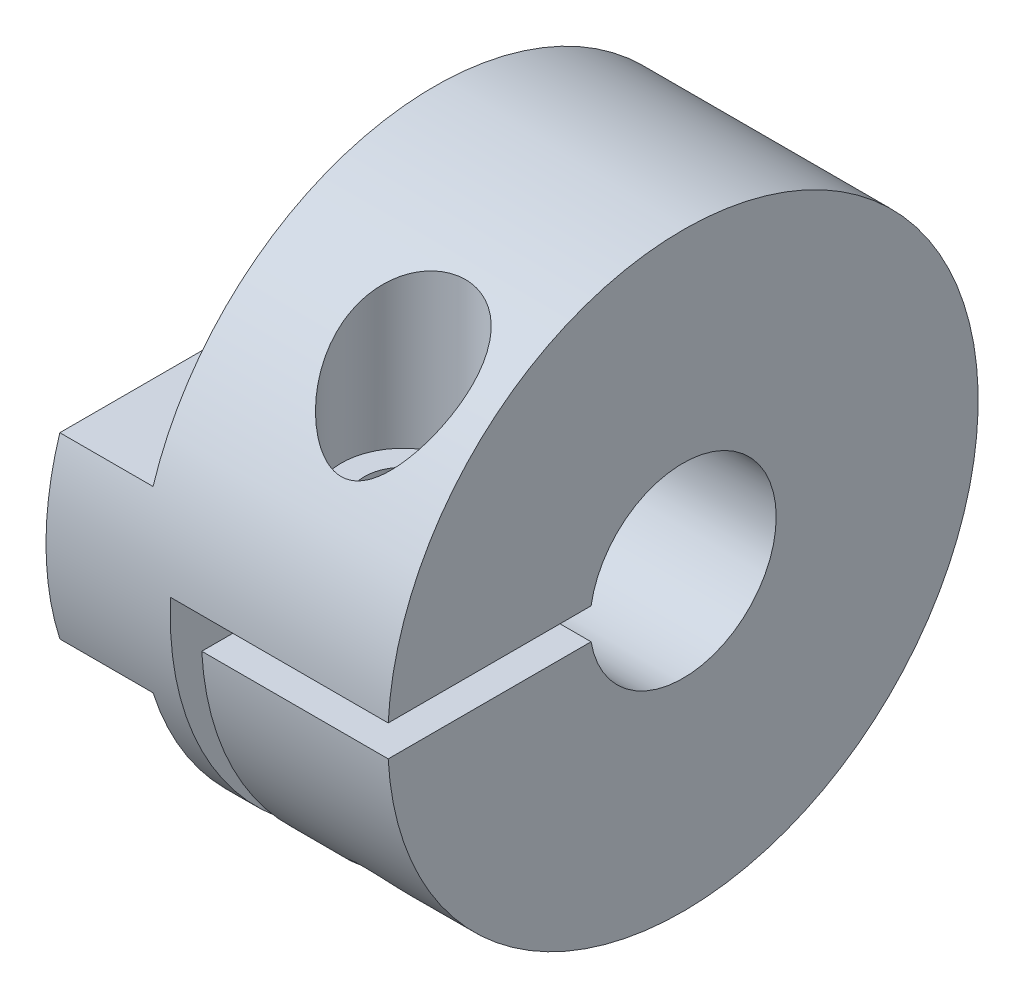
ISO-10303-21;
HEADER;
FILE_DESCRIPTION(('STEP AP214'),'2;1');
FILE_NAME('part.step','',(''),(''),'','','');
FILE_SCHEMA(('AUTOMOTIVE_DESIGN { 1 0 10303 214 1 1 1 1 }'));
ENDSEC;
DATA;
#1=APPLICATION_CONTEXT('core data for automotive mechanical design processes');
#2=APPLICATION_PROTOCOL_DEFINITION('international standard','automotive_design',2000,#1);
#3=PRODUCT_CONTEXT('',#1,'mechanical');
#4=PRODUCT('Part','Part','',(#3));
#5=PRODUCT_RELATED_PRODUCT_CATEGORY('part','',(#4));
#6=PRODUCT_DEFINITION_FORMATION('','',#4);
#7=PRODUCT_DEFINITION_CONTEXT('part definition',#1,'design');
#8=PRODUCT_DEFINITION('design','',#6,#7);
#9=PRODUCT_DEFINITION_SHAPE('','',#8);
#10=(LENGTH_UNIT() NAMED_UNIT(*) SI_UNIT(.MILLI.,.METRE.));
#11=(NAMED_UNIT(*) PLANE_ANGLE_UNIT() SI_UNIT($,.RADIAN.));
#12=(NAMED_UNIT(*) SI_UNIT($,.STERADIAN.) SOLID_ANGLE_UNIT());
#13=UNCERTAINTY_MEASURE_WITH_UNIT(LENGTH_MEASURE(1.E-05),#10,'distance_accuracy_value','');
#14=(GEOMETRIC_REPRESENTATION_CONTEXT(3) GLOBAL_UNCERTAINTY_ASSIGNED_CONTEXT((#13)) GLOBAL_UNIT_ASSIGNED_CONTEXT((#10,
#11,#12)) REPRESENTATION_CONTEXT('',''));
#15=CARTESIAN_POINT('',(0.,0.,0.));
#16=DIRECTION('',(0.,0.,1.));
#17=DIRECTION('',(1.,0.,0.));
#18=AXIS2_PLACEMENT_3D('',#15,#16,#17);
#19=CARTESIAN_POINT('',(0.,0.,0.));
#20=DIRECTION('',(-1.,0.,0.));
#21=DIRECTION('',(0.,0.,1.));
#22=AXIS2_PLACEMENT_3D('',#19,#20,#21);
#23=CYLINDRICAL_SURFACE('',#22,3.);
#24=CARTESIAN_POINT('',(11.,0.,0.));
#25=DIRECTION('',(-1.,0.,0.));
#26=DIRECTION('',(0.,0.,1.));
#27=AXIS2_PLACEMENT_3D('',#24,#25,#26);
#28=CIRCLE('',#27,3.);
#29=CARTESIAN_POINT('',(11.,0.499999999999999,2.95803989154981));
#30=VERTEX_POINT('',#29);
#31=CARTESIAN_POINT('',(11.,-0.5,2.95803989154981));
#32=VERTEX_POINT('',#31);
#33=EDGE_CURVE('E129',#30,#32,#28,.T.);
#34=ORIENTED_EDGE('',*,*,#33,.F.);
#35=DIRECTION('',(-1.,0.,0.));
#36=VECTOR('',#35,1.);
#37=CARTESIAN_POINT('',(0.,0.499999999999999,2.95803989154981));
#38=LINE('',#37,#36);
#39=CARTESIAN_POINT('',(4.,0.499999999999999,2.95803989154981));
#40=VERTEX_POINT('',#39);
#41=EDGE_CURVE('E117',#30,#40,#38,.T.);
#42=ORIENTED_EDGE('',*,*,#41,.T.);
#43=CARTESIAN_POINT('',(4.,0.,0.));
#44=DIRECTION('',(-1.,0.,0.));
#45=DIRECTION('',(0.,0.,1.));
#46=AXIS2_PLACEMENT_3D('',#43,#44,#45);
#47=CIRCLE('',#46,3.);
#48=CARTESIAN_POINT('',(4.,0.,-3.));
#49=VERTEX_POINT('',#48);
#50=EDGE_CURVE('E127',#40,#49,#47,.T.);
#51=ORIENTED_EDGE('',*,*,#50,.T.);
#52=DIRECTION('',(-1.,0.,0.));
#53=VECTOR('',#52,1.);
#54=CARTESIAN_POINT('',(0.,0.,-3.));
#55=LINE('',#54,#53);
#56=CARTESIAN_POINT('',(5.,0.,-3.));
#57=VERTEX_POINT('',#56);
#58=EDGE_CURVE('E165',#57,#49,#55,.T.);
#59=ORIENTED_EDGE('',*,*,#58,.F.);
#60=CARTESIAN_POINT('',(5.,0.,0.));
#61=DIRECTION('',(1.,0.,0.));
#62=DIRECTION('',(0.,0.,-1.));
#63=AXIS2_PLACEMENT_3D('',#60,#61,#62);
#64=CIRCLE('',#63,3.);
#65=CARTESIAN_POINT('',(5.,-0.499999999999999,2.95803989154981));
#66=VERTEX_POINT('',#65);
#67=EDGE_CURVE('E163',#57,#66,#64,.F.);
#68=ORIENTED_EDGE('',*,*,#67,.T.);
#69=DIRECTION('',(-1.,0.,0.));
#70=VECTOR('',#69,1.);
#71=CARTESIAN_POINT('',(0.,-0.5,2.95803989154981));
#72=LINE('',#71,#70);
#73=EDGE_CURVE('E50',#66,#32,#72,.F.);
#74=ORIENTED_EDGE('',*,*,#73,.T.);
#75=EDGE_LOOP('',(#34,#42,#51,#59,#68,#74));
#76=FACE_BOUND('',#75,.T.);
#77=ADVANCED_FACE('F34',(#76),#23,.F.);
#78=CARTESIAN_POINT('',(0.,0.,0.));
#79=DIRECTION('',(-1.,0.,0.));
#80=DIRECTION('',(0.,0.,1.));
#81=AXIS2_PLACEMENT_3D('',#78,#79,#80);
#82=CYLINDRICAL_SURFACE('',#81,1.5);
#83=CARTESIAN_POINT('',(4.,0.,0.));
#84=DIRECTION('',(-1.,0.,0.));
#85=DIRECTION('',(0.,0.,1.));
#86=AXIS2_PLACEMENT_3D('',#83,#84,#85);
#87=CIRCLE('',#86,1.5);
#88=CARTESIAN_POINT('',(4.,0.,1.5));
#89=VERTEX_POINT('',#88);
#90=EDGE_CURVE('E136',#89,#89,#87,.T.);
#91=ORIENTED_EDGE('',*,*,#90,.F.);
#92=EDGE_LOOP('',(#91));
#93=FACE_BOUND('',#92,.T.);
#94=CARTESIAN_POINT('',(0.,0.,0.));
#95=DIRECTION('',(-1.,0.,0.));
#96=DIRECTION('',(0.,0.,1.));
#97=AXIS2_PLACEMENT_3D('',#94,#95,#96);
#98=CIRCLE('',#97,1.5);
#99=CARTESIAN_POINT('',(0.,0.,1.5));
#100=VERTEX_POINT('',#99);
#101=EDGE_CURVE('E189',#100,#100,#98,.T.);
#102=ORIENTED_EDGE('',*,*,#101,.T.);
#103=EDGE_LOOP('',(#102));
#104=FACE_BOUND('',#103,.T.);
#105=ADVANCED_FACE('F36',(#93,#104),#82,.F.);
#106=CARTESIAN_POINT('',(4.,3.,0.));
#107=DIRECTION('',(-1.,0.,0.));
#108=DIRECTION('',(0.,0.,1.));
#109=AXIS2_PLACEMENT_3D('',#106,#107,#108);
#110=PLANE('',#109);
#111=ORIENTED_EDGE('',*,*,#50,.F.);
#112=DIRECTION('',(0.,0.,1.));
#113=VECTOR('',#112,1.);
#114=CARTESIAN_POINT('',(4.,0.499999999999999,9.5));
#115=LINE('',#114,#113);
#116=CARTESIAN_POINT('',(4.,0.499999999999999,9.48683298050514));
#117=VERTEX_POINT('',#116);
#118=EDGE_CURVE('E114',#40,#117,#115,.T.);
#119=ORIENTED_EDGE('',*,*,#118,.T.);
#120=CARTESIAN_POINT('',(4.,0.,0.));
#121=DIRECTION('',(-1.,0.,0.));
#122=DIRECTION('',(0.,0.,1.));
#123=AXIS2_PLACEMENT_3D('',#120,#121,#122);
#124=CIRCLE('',#123,9.5);
#125=CARTESIAN_POINT('',(4.,0.,-9.5));
#126=VERTEX_POINT('',#125);
#127=EDGE_CURVE('E157',#126,#117,#124,.T.);
#128=ORIENTED_EDGE('',*,*,#127,.F.);
#129=DIRECTION('',(0.,0.,1.));
#130=VECTOR('',#129,1.);
#131=CARTESIAN_POINT('',(4.,0.,9.5));
#132=LINE('',#131,#130);
#133=EDGE_CURVE('E130',#126,#49,#132,.T.);
#134=ORIENTED_EDGE('',*,*,#133,.T.);
#135=EDGE_LOOP('',(#111,#119,#128,#134));
#136=FACE_BOUND('',#135,.T.);
#137=ORIENTED_EDGE('',*,*,#90,.T.);
#138=EDGE_LOOP('',(#137));
#139=FACE_BOUND('',#138,.T.);
#140=ADVANCED_FACE('F133',(#136,#139),#110,.F.);
#141=CARTESIAN_POINT('',(11.,9.5,0.));
#142=DIRECTION('',(-1.,0.,0.));
#143=DIRECTION('',(0.,0.,1.));
#144=AXIS2_PLACEMENT_3D('',#141,#142,#143);
#145=PLANE('',#144);
#146=CARTESIAN_POINT('',(11.,0.,0.));
#147=DIRECTION('',(-1.,0.,0.));
#148=DIRECTION('',(0.,0.,1.));
#149=AXIS2_PLACEMENT_3D('',#146,#147,#148);
#150=CIRCLE('',#149,9.5);
#151=CARTESIAN_POINT('',(11.,0.499999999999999,9.48683298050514));
#152=VERTEX_POINT('',#151);
#153=CARTESIAN_POINT('',(11.,-0.500000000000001,9.48683298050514));
#154=VERTEX_POINT('',#153);
#155=EDGE_CURVE('E141',#152,#154,#150,.T.);
#156=ORIENTED_EDGE('',*,*,#155,.F.);
#157=DIRECTION('',(0.,0.,1.));
#158=VECTOR('',#157,1.);
#159=CARTESIAN_POINT('',(11.,0.499999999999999,9.5));
#160=LINE('',#159,#158);
#161=EDGE_CURVE('E122',#30,#152,#160,.T.);
#162=ORIENTED_EDGE('',*,*,#161,.F.);
#163=ORIENTED_EDGE('',*,*,#33,.T.);
#164=DIRECTION('',(0.,0.,-1.));
#165=VECTOR('',#164,1.);
#166=CARTESIAN_POINT('',(11.,-0.500000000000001,9.5));
#167=LINE('',#166,#165);
#168=EDGE_CURVE('E203',#154,#32,#167,.T.);
#169=ORIENTED_EDGE('',*,*,#168,.F.);
#170=EDGE_LOOP('',(#156,#162,#163,#169));
#171=FACE_BOUND('',#170,.T.);
#172=ADVANCED_FACE('F202',(#171),#145,.F.);
#173=CARTESIAN_POINT('',(0.,0.,0.));
#174=DIRECTION('',(-1.,0.,0.));
#175=DIRECTION('',(0.,0.,1.));
#176=AXIS2_PLACEMENT_3D('',#173,#174,#175);
#177=CYLINDRICAL_SURFACE('',#176,9.5);
#178=CARTESIAN_POINT('',(8.,8.61684396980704,4.));
#179=CARTESIAN_POINT('',(7.89635525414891,8.61684430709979,3.9999985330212));
#180=CARTESIAN_POINT('',(7.79271934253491,8.61310411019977,4.00808600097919));
#181=CARTESIAN_POINT('',(7.58848065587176,8.59814850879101,4.04006803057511));
#182=CARTESIAN_POINT('',(7.48787768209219,8.58693359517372,4.06396155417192));
#183=CARTESIAN_POINT('',(7.29265445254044,8.55707459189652,4.12645866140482));
#184=CARTESIAN_POINT('',(7.19802785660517,8.53843853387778,4.16504634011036));
#185=CARTESIAN_POINT('',(7.01710450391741,8.49384073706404,4.25525429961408));
#186=CARTESIAN_POINT('',(6.9308081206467,8.46787867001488,4.30687516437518));
#187=CARTESIAN_POINT('',(6.76664597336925,8.40818372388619,4.42230117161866));
#188=CARTESIAN_POINT('',(6.68901578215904,8.37428796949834,4.48635608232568));
#189=CARTESIAN_POINT('',(6.54588930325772,8.29948416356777,4.6232719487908));
#190=CARTESIAN_POINT('',(6.4803956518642,8.25857459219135,4.69613481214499));
#191=CARTESIAN_POINT('',(6.35756029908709,8.16682598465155,4.85406210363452));
#192=CARTESIAN_POINT('',(6.30127220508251,8.11545767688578,4.93963575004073));
#193=CARTESIAN_POINT('',(6.20367430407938,8.00611550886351,5.11495912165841));
#194=CARTESIAN_POINT('',(6.16237132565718,7.94813865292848,5.20471072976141));
#195=CARTESIAN_POINT('',(6.08951692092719,7.81822768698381,5.39820906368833));
#196=CARTESIAN_POINT('',(6.06007167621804,7.74546914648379,5.50219108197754));
#197=CARTESIAN_POINT('',(6.0184181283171,7.5941081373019,5.70929270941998));
#198=CARTESIAN_POINT('',(6.00621901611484,7.51550257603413,5.81241182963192));
#199=CARTESIAN_POINT('',(5.99663147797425,7.33816855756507,6.03533342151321));
#200=CARTESIAN_POINT('',(6.00255530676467,7.23848403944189,6.15451542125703));
#201=CARTESIAN_POINT('',(6.03418237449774,7.03478866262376,6.38636519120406));
#202=CARTESIAN_POINT('',(6.05990369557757,6.93077393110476,6.49902690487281));
#203=CARTESIAN_POINT('',(6.13667294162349,6.69771494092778,6.73975354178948));
#204=CARTESIAN_POINT('',(6.19197286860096,6.56809155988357,6.86593219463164));
#205=CARTESIAN_POINT('',(6.29328570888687,6.37394253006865,7.04490400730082));
#206=CARTESIAN_POINT('',(6.33014839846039,6.30923005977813,7.10288107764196));
#207=CARTESIAN_POINT('',(6.41001740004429,6.18047253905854,7.21519592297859));
#208=CARTESIAN_POINT('',(6.4530220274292,6.11642731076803,7.26953468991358));
#209=CARTESIAN_POINT('',(6.56925401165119,5.95677294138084,7.40151160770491));
#210=CARTESIAN_POINT('',(6.64660071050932,5.86199093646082,7.47664568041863));
#211=CARTESIAN_POINT('',(6.77438612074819,5.72498162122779,7.58141923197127));
#212=CARTESIAN_POINT('',(6.81891545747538,5.68019482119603,7.61500679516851));
#213=CARTESIAN_POINT('',(6.91220961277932,5.59301872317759,7.67926194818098));
#214=CARTESIAN_POINT('',(6.96097236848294,5.55062827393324,7.70993094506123));
#215=CARTESIAN_POINT('',(7.0755145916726,5.4592174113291,7.77501149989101));
#216=CARTESIAN_POINT('',(7.14254679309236,5.41109515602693,7.80851663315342));
#217=CARTESIAN_POINT('',(7.28423196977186,5.32258380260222,7.8691150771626));
#218=CARTESIAN_POINT('',(7.35887340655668,5.2821832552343,7.89621789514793));
#219=CARTESIAN_POINT('',(7.4977171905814,5.22075585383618,7.93692311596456));
#220=CARTESIAN_POINT('',(7.56038400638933,5.19741064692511,7.95219634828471));
#221=CARTESIAN_POINT('',(7.68944001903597,5.15952752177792,7.97682847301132));
#222=CARTESIAN_POINT('',(7.75582405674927,5.14497771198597,7.98619535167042));
#223=CARTESIAN_POINT('',(7.89122967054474,5.12629359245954,7.99820285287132));
#224=CARTESIAN_POINT('',(7.9602677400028,5.12224113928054,8.00079061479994));
#225=CARTESIAN_POINT('',(8.09798783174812,5.12537201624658,7.99878514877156));
#226=CARTESIAN_POINT('',(8.16666979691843,5.13255709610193,7.9941908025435));
#227=CARTESIAN_POINT('',(8.29396177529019,5.15581753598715,7.97920436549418));
#228=CARTESIAN_POINT('',(8.35285526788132,5.17084201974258,7.96949651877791));
#229=CARTESIAN_POINT('',(8.46746525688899,5.20766403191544,7.94548422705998));
#230=CARTESIAN_POINT('',(8.52318037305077,5.22946447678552,7.93117780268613));
#231=CARTESIAN_POINT('',(8.66594864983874,5.29427147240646,7.88815599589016));
#232=CARTESIAN_POINT('',(8.74990354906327,5.34186370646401,7.85611197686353));
#233=CARTESIAN_POINT('',(8.90814612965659,5.44632135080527,7.78406267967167));
#234=CARTESIAN_POINT('',(8.98239932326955,5.50321830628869,7.74403021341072));
#235=CARTESIAN_POINT('',(9.10943640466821,5.61202262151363,7.66543398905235));
#236=CARTESIAN_POINT('',(9.16368198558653,5.66299359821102,7.62789543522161));
#237=CARTESIAN_POINT('',(9.26667725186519,5.76760357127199,7.54910849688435));
#238=CARTESIAN_POINT('',(9.31542340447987,5.82124425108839,7.50785775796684));
#239=CARTESIAN_POINT('',(9.40777701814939,5.93029912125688,7.42201928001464));
#240=CARTESIAN_POINT('',(9.45138169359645,5.98571425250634,7.37742975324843));
#241=CARTESIAN_POINT('',(9.53366339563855,6.09765415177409,7.28518283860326));
#242=CARTESIAN_POINT('',(9.57233841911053,6.15417936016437,7.23752421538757));
#243=CARTESIAN_POINT('',(9.68537454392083,6.33123032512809,7.08453834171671));
#244=CARTESIAN_POINT('',(9.75143437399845,6.45283149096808,6.97417009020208));
#245=CARTESIAN_POINT('',(9.86165687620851,6.69494496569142,6.7420966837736));
#246=CARTESIAN_POINT('',(9.90582935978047,6.81545773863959,6.62039663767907));
#247=CARTESIAN_POINT('',(9.97030977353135,7.05248102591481,6.36730040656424));
#248=CARTESIAN_POINT('',(9.99064539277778,7.16899603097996,6.23591566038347));
#249=CARTESIAN_POINT('',(10.0042578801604,7.39515803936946,5.96594552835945));
#250=CARTESIAN_POINT('',(9.99756245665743,7.50481195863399,5.82736765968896));
#251=CARTESIAN_POINT('',(9.95779109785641,7.69272288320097,5.57597199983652));
#252=CARTESIAN_POINT('',(9.93035695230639,7.77282992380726,5.46364673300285));
#253=CARTESIAN_POINT('',(9.85395087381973,7.9249219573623,5.24058541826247));
#254=CARTESIAN_POINT('',(9.80498686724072,7.9969099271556,5.12984880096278));
#255=CARTESIAN_POINT('',(9.71438749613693,8.09764442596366,4.96812815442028));
#256=CARTESIAN_POINT('',(9.68111845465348,8.13015893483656,4.91469570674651));
#257=CARTESIAN_POINT('',(9.6088356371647,8.19242792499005,4.81017746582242));
#258=CARTESIAN_POINT('',(9.56982503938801,8.22218391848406,4.75909039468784));
#259=CARTESIAN_POINT('',(9.48615435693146,8.27873590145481,4.66002023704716));
#260=CARTESIAN_POINT('',(9.4414964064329,8.3055330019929,4.61203598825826));
#261=CARTESIAN_POINT('',(9.34678262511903,8.35600408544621,4.51995075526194));
#262=CARTESIAN_POINT('',(9.29672791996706,8.37967871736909,4.4758489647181));
#263=CARTESIAN_POINT('',(9.15464283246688,8.43924151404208,4.36298632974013));
#264=CARTESIAN_POINT('',(9.05775592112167,8.47207885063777,4.29857354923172));
#265=CARTESIAN_POINT('',(8.85210557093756,8.52786306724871,4.18682418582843));
#266=CARTESIAN_POINT('',(8.74335060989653,8.55081695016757,4.13947551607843));
#267=CARTESIAN_POINT('',(8.52981391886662,8.58477886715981,4.06853131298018));
#268=CARTESIAN_POINT('',(8.42585595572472,8.59680367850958,4.04293363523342));
#269=CARTESIAN_POINT('',(8.21459479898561,8.61283479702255,4.00867139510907));
#270=CARTESIAN_POINT('',(8.10729266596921,8.61684362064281,4.00000151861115));
#271=CARTESIAN_POINT('',(8.,8.61684396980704,4.));
#272=B_SPLINE_CURVE_WITH_KNOTS('',3,(#178,#179,#180,#181,#182,#183,#184,#185,#186,#187,#188,
#189,#190,#191,#192,#193,#194,#195,#196,#197,#198,#199,#200,#201,#202,#203,#204,#205,#206,#207,
#208,#209,#210,#211,#212,#213,#214,#215,#216,#217,#218,#219,#220,#221,#222,#223,#224,#225,#226,
#227,#228,#229,#230,#231,#232,#233,#234,#235,#236,#237,#238,#239,#240,#241,#242,#243,#244,#245,
#246,#247,#248,#249,#250,#251,#252,#253,#254,#255,#256,#257,#258,#259,#260,#261,#262,#263,#264,
#265,#266,#267,#268,#269,#270,#271),.UNSPECIFIED.,.T.,.F.,(4,2,2,2,2,2,2,2,2,2,2,2,2,2,2,2,2,2,
2,2,2,2,2,2,2,2,2,2,2,2,2,2,2,2,2,2,2,2,2,2,2,2,2,2,2,2,4),(0.,0.310541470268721,
0.621062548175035,0.931248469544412,1.2414482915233,1.55868286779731,1.87598627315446,
2.2183713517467,2.56091225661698,2.95029999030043,3.33989516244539,3.80466997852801,
4.26986980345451,4.83494908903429,5.1178728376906,5.40071913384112,5.83001775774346,
6.04444005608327,6.25875845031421,6.52525005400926,6.79134340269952,6.99636922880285,
7.20111723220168,7.40745708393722,7.61382906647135,7.79777619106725,7.98180259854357,
8.28512454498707,8.58949699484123,8.83925862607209,9.08917979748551,9.33923575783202,
9.58939300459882,10.1185225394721,10.647414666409,11.175691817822,11.7034275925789,
12.123840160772,12.5440980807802,12.7563631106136,12.9685110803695,13.1805791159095,
13.3926030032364,13.753040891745,14.1132229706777,14.4347953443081,14.7562667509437),.UNSPECIFIED.);
#273=CARTESIAN_POINT('',(8.,8.61684396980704,4.));
#274=VERTEX_POINT('',#273);
#275=EDGE_CURVE('E366',#274,#274,#272,.T.);
#276=ORIENTED_EDGE('',*,*,#275,.F.);
#277=EDGE_LOOP('',(#276));
#278=FACE_BOUND('',#277,.T.);
#279=CARTESIAN_POINT('',(8.,-6.13901457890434,7.25));
#280=CARTESIAN_POINT('',(8.05388156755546,-6.13902178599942,7.24999465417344));
#281=CARTESIAN_POINT('',(8.10785580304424,-6.14318592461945,7.24647417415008));
#282=CARTESIAN_POINT('',(8.21379511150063,-6.15933965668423,7.23274763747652));
#283=CARTESIAN_POINT('',(8.26575410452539,-6.17135123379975,7.22252279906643));
#284=CARTESIAN_POINT('',(8.36559999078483,-6.20174236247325,7.1964423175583));
#285=CARTESIAN_POINT('',(8.41352315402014,-6.22005540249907,7.18064544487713));
#286=CARTESIAN_POINT('',(8.50521818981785,-6.26163487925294,7.14441677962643));
#287=CARTESIAN_POINT('',(8.54898925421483,-6.28490227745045,7.12398408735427));
#288=CARTESIAN_POINT('',(8.6547322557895,-6.34869929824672,7.06729570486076));
#289=CARTESIAN_POINT('',(8.71377999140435,-6.39176871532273,7.02845141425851));
#290=CARTESIAN_POINT('',(8.82214123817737,-6.4833196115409,6.94409669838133));
#291=CARTESIAN_POINT('',(8.87142785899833,-6.53181548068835,6.89856844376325));
#292=CARTESIAN_POINT('',(8.97781196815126,-6.65108211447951,6.78397098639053));
#293=CARTESIAN_POINT('',(9.03074035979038,-6.72330457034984,6.71253806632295));
#294=CARTESIAN_POINT('',(9.11986278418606,-6.870144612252,6.56217998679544));
#295=CARTESIAN_POINT('',(9.15604426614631,-6.94476394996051,6.48324926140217));
#296=CARTESIAN_POINT('',(9.21195840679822,-7.09514351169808,6.31835224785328));
#297=CARTESIAN_POINT('',(9.23142687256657,-7.17090345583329,6.23229572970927));
#298=CARTESIAN_POINT('',(9.25187158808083,-7.32022884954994,6.05619826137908));
#299=CARTESIAN_POINT('',(9.25286477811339,-7.3937962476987,5.96616103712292));
#300=CARTESIAN_POINT('',(9.23620122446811,-7.52474374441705,5.79978655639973));
#301=CARTESIAN_POINT('',(9.22161832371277,-7.58278131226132,5.72366088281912));
#302=CARTESIAN_POINT('',(9.1772885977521,-7.69447105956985,5.57260221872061));
#303=CARTESIAN_POINT('',(9.14756026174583,-7.74812849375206,5.49766788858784));
#304=CARTESIAN_POINT('',(9.07868291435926,-7.84057544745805,5.36476935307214));
#305=CARTESIAN_POINT('',(9.04211000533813,-7.88032019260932,5.30613824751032));
#306=CARTESIAN_POINT('',(8.95784816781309,-7.95480440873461,5.1938059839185));
#307=CARTESIAN_POINT('',(8.91016151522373,-7.98954490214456,5.14010381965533));
#308=CARTESIAN_POINT('',(8.80364150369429,-8.05321926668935,5.03976445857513));
#309=CARTESIAN_POINT('',(8.74472544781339,-8.08210655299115,4.99318461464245));
#310=CARTESIAN_POINT('',(8.61726491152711,-8.13267463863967,4.91039407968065));
#311=CARTESIAN_POINT('',(8.54872884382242,-8.15436167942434,4.87417441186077));
#312=CARTESIAN_POINT('',(8.41428793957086,-8.18723290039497,4.81872542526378));
#313=CARTESIAN_POINT('',(8.34931402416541,-8.19945034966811,4.79784603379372));
#314=CARTESIAN_POINT('',(8.21599415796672,-8.21747673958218,4.76690722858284));
#315=CARTESIAN_POINT('',(8.14765057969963,-8.2232901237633,4.75684031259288));
#316=CARTESIAN_POINT('',(8.01669044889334,-8.22807441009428,4.74855847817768));
#317=CARTESIAN_POINT('',(7.95415974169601,-8.22765305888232,4.7492908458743));
#318=CARTESIAN_POINT('',(7.83018142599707,-8.2214457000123,4.76002826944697));
#319=CARTESIAN_POINT('',(7.76873357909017,-8.21566088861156,4.77003125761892));
#320=CARTESIAN_POINT('',(7.64982646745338,-8.19905115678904,4.7985229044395));
#321=CARTESIAN_POINT('',(7.59231357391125,-8.18832417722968,4.81684657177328));
#322=CARTESIAN_POINT('',(7.48144043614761,-8.16214731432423,4.86107066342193));
#323=CARTESIAN_POINT('',(7.42808071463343,-8.1466968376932,4.88697203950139));
#324=CARTESIAN_POINT('',(7.32417861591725,-8.11059960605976,4.94665976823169));
#325=CARTESIAN_POINT('',(7.27389480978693,-8.08973884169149,4.98076519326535));
#326=CARTESIAN_POINT('',(7.17994648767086,-8.04374866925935,5.05470095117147));
#327=CARTESIAN_POINT('',(7.13628422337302,-8.01861781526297,5.09453322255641));
#328=CARTESIAN_POINT('',(7.05174198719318,-7.96173658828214,5.18302972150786));
#329=CARTESIAN_POINT('',(7.01165902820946,-7.92956570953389,5.23218291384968));
#330=CARTESIAN_POINT('',(6.94032112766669,-7.86138681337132,5.33407557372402));
#331=CARTESIAN_POINT('',(6.90907069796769,-7.82537684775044,5.38681685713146));
#332=CARTESIAN_POINT('',(6.85097965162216,-7.74427438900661,5.50290600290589));
#333=CARTESIAN_POINT('',(6.82561268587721,-7.69864529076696,5.56661444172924));
#334=CARTESIAN_POINT('',(6.78590993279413,-7.60414757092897,5.69502534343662));
#335=CARTESIAN_POINT('',(6.77158010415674,-7.55527721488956,5.75972832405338));
#336=CARTESIAN_POINT('',(6.75151763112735,-7.44564755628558,5.90099593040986));
#337=CARTESIAN_POINT('',(6.74793316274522,-7.38439234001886,5.9774808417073));
#338=CARTESIAN_POINT('',(6.75430140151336,-7.25980650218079,6.12819717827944));
#339=CARTESIAN_POINT('',(6.7642674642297,-7.19647389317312,6.20242630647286));
#340=CARTESIAN_POINT('',(6.79979853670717,-7.05779101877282,6.36006603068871));
#341=CARTESIAN_POINT('',(6.82779769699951,-6.98228526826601,6.44279682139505));
#342=CARTESIAN_POINT('',(6.90079308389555,-6.83236340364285,6.6015690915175));
#343=CARTESIAN_POINT('',(6.94579017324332,-6.75794734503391,6.67761023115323));
#344=CARTESIAN_POINT('',(7.04078498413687,-6.62989087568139,6.804463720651));
#345=CARTESIAN_POINT('',(7.08726431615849,-6.57540235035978,6.85706069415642));
#346=CARTESIAN_POINT('',(7.1911026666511,-6.47099823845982,6.95566647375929));
#347=CARTESIAN_POINT('',(7.24844088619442,-6.42107417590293,7.00168758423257));
#348=CARTESIAN_POINT('',(7.35547101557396,-6.3430520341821,7.07231046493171));
#349=CARTESIAN_POINT('',(7.40219041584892,-6.31293201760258,7.09917110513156));
#350=CARTESIAN_POINT('',(7.50130589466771,-6.25812282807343,7.14753307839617));
#351=CARTESIAN_POINT('',(7.55369496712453,-6.23342706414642,7.16904091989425));
#352=CARTESIAN_POINT('',(7.65244218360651,-6.19576553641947,7.20159581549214));
#353=CARTESIAN_POINT('',(7.69786810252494,-6.18143653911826,7.21387982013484));
#354=CARTESIAN_POINT('',(7.79117355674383,-6.15864539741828,7.23334751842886));
#355=CARTESIAN_POINT('',(7.83904625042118,-6.15016776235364,7.24054468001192));
#356=CARTESIAN_POINT('',(7.906109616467,-6.14301575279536,7.24661040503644));
#357=CARTESIAN_POINT('',(7.9248288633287,-6.14151891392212,7.24787883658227));
#358=CARTESIAN_POINT('',(7.9623616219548,-6.13951694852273,7.24957466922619));
#359=CARTESIAN_POINT('',(7.98117515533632,-6.13901206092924,7.25000186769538));
#360=CARTESIAN_POINT('',(8.,-6.13901457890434,7.25));
#361=B_SPLINE_CURVE_WITH_KNOTS('',3,(#279,#280,#281,#282,#283,#284,#285,#286,#287,#288,#289,
#290,#291,#292,#293,#294,#295,#296,#297,#298,#299,#300,#301,#302,#303,#304,#305,#306,#307,#308,
#309,#310,#311,#312,#313,#314,#315,#316,#317,#318,#319,#320,#321,#322,#323,#324,#325,#326,#327,
#328,#329,#330,#331,#332,#333,#334,#335,#336,#337,#338,#339,#340,#341,#342,#343,#344,#345,#346,
#347,#348,#349,#350,#351,#352,#353,#354,#355,#356,#357,#358,#359,#360),.UNSPECIFIED.,.T.,.F.,(4,
2,2,2,2,2,2,2,2,2,2,2,2,2,2,2,2,2,2,2,2,2,2,2,2,2,2,2,2,2,2,2,2,2,2,2,2,2,2,2,4),(0.,
0.161549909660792,0.323554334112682,0.48389875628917,0.644274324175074,0.891192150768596,
1.13878101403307,1.48062246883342,1.8227196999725,2.17013002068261,2.51722177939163,
2.80659546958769,3.0956167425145,3.33381099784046,3.57195651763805,3.81192877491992,
4.05169246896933,4.25853370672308,4.46523133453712,4.65192543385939,4.83857790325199,
5.02168076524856,5.20480663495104,5.396731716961,5.5887219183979,5.80124586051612,
6.01387816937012,6.26005820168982,6.5063710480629,6.79943779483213,7.09279360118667,
7.43771803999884,7.78265998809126,8.04842785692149,8.31369173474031,8.49833470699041,
8.68275206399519,8.82976172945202,8.97638069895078,9.03280852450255,9.08924994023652),.UNSPECIFIED.);
#362=CARTESIAN_POINT('',(8.,-6.13901457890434,7.25));
#363=VERTEX_POINT('',#362);
#364=EDGE_CURVE('E204',#363,#363,#361,.T.);
#365=ORIENTED_EDGE('',*,*,#364,.T.);
#366=EDGE_LOOP('',(#365));
#367=FACE_BOUND('',#366,.T.);
#368=ORIENTED_EDGE('',*,*,#155,.T.);
#369=DIRECTION('',(-1.,0.,0.));
#370=VECTOR('',#369,1.);
#371=CARTESIAN_POINT('',(0.,-0.500000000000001,9.48683298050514));
#372=LINE('',#371,#370);
#373=CARTESIAN_POINT('',(5.,-0.5,9.48683298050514));
#374=VERTEX_POINT('',#373);
#375=EDGE_CURVE('E121',#154,#374,#372,.T.);
#376=ORIENTED_EDGE('',*,*,#375,.T.);
#377=CARTESIAN_POINT('',(5.,0.,0.));
#378=DIRECTION('',(1.,0.,0.));
#379=DIRECTION('',(0.,0.,-1.));
#380=AXIS2_PLACEMENT_3D('',#377,#378,#379);
#381=CIRCLE('',#380,9.5);
#382=CARTESIAN_POINT('',(5.,0.,-9.5));
#383=VERTEX_POINT('',#382);
#384=EDGE_CURVE('E155',#374,#383,#381,.T.);
#385=ORIENTED_EDGE('',*,*,#384,.T.);
#386=DIRECTION('',(-1.,0.,0.));
#387=VECTOR('',#386,1.);
#388=CARTESIAN_POINT('',(4.,0.,-9.5));
#389=LINE('',#388,#387);
#390=EDGE_CURVE('E171',#383,#126,#389,.T.);
#391=ORIENTED_EDGE('',*,*,#390,.T.);
#392=ORIENTED_EDGE('',*,*,#127,.T.);
#393=DIRECTION('',(-1.,0.,0.));
#394=VECTOR('',#393,1.);
#395=CARTESIAN_POINT('',(0.,0.499999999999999,9.48683298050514));
#396=LINE('',#395,#394);
#397=EDGE_CURVE('E11',#117,#152,#396,.F.);
#398=ORIENTED_EDGE('',*,*,#397,.T.);
#399=EDGE_LOOP('',(#368,#376,#385,#391,#392,#398));
#400=FACE_BOUND('',#399,.T.);
#401=CARTESIAN_POINT('',(0.,0.,0.));
#402=DIRECTION('',(-1.,0.,0.));
#403=DIRECTION('',(0.,0.,1.));
#404=AXIS2_PLACEMENT_3D('',#401,#402,#403);
#405=CIRCLE('',#404,9.5);
#406=CARTESIAN_POINT('',(0.,-2.875,9.05452235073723));
#407=VERTEX_POINT('',#406);
#408=CARTESIAN_POINT('',(0.,2.875,9.05452235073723));
#409=VERTEX_POINT('',#408);
#410=EDGE_CURVE('E192',#407,#409,#405,.T.);
#411=ORIENTED_EDGE('',*,*,#410,.F.);
#412=DIRECTION('',(-1.,0.,0.));
#413=VECTOR('',#412,1.);
#414=CARTESIAN_POINT('',(0.,-2.875,9.05452235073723));
#415=LINE('',#414,#413);
#416=CARTESIAN_POINT('',(3.,-2.875,9.05452235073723));
#417=VERTEX_POINT('',#416);
#418=EDGE_CURVE('E169',#407,#417,#415,.F.);
#419=ORIENTED_EDGE('',*,*,#418,.T.);
#420=CARTESIAN_POINT('',(3.,0.,0.));
#421=DIRECTION('',(1.,0.,0.));
#422=DIRECTION('',(0.,1.,0.));
#423=AXIS2_PLACEMENT_3D('',#420,#421,#422);
#424=CIRCLE('',#423,9.5);
#425=CARTESIAN_POINT('',(3.,-2.875,-9.05452235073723));
#426=VERTEX_POINT('',#425);
#427=EDGE_CURVE('E152',#417,#426,#424,.T.);
#428=ORIENTED_EDGE('',*,*,#427,.T.);
#429=DIRECTION('',(-1.,0.,0.));
#430=VECTOR('',#429,1.);
#431=CARTESIAN_POINT('',(0.,-2.875,-9.05452235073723));
#432=LINE('',#431,#430);
#433=CARTESIAN_POINT('',(0.,-2.875,-9.05452235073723));
#434=VERTEX_POINT('',#433);
#435=EDGE_CURVE('E177',#426,#434,#432,.T.);
#436=ORIENTED_EDGE('',*,*,#435,.T.);
#437=CARTESIAN_POINT('',(0.,2.875,-9.05452235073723));
#438=VERTEX_POINT('',#437);
#439=EDGE_CURVE('E193',#438,#434,#405,.T.);
#440=ORIENTED_EDGE('',*,*,#439,.F.);
#441=DIRECTION('',(-1.,0.,0.));
#442=VECTOR('',#441,1.);
#443=CARTESIAN_POINT('',(0.,2.875,-9.05452235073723));
#444=LINE('',#443,#442);
#445=CARTESIAN_POINT('',(3.,2.875,-9.05452235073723));
#446=VERTEX_POINT('',#445);
#447=EDGE_CURVE('E183',#438,#446,#444,.F.);
#448=ORIENTED_EDGE('',*,*,#447,.T.);
#449=CARTESIAN_POINT('',(3.,0.,0.));
#450=DIRECTION('',(1.,0.,0.));
#451=DIRECTION('',(0.,1.,0.));
#452=AXIS2_PLACEMENT_3D('',#449,#450,#451);
#453=CIRCLE('',#452,9.5);
#454=CARTESIAN_POINT('',(3.,2.875,9.05452235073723));
#455=VERTEX_POINT('',#454);
#456=EDGE_CURVE('E147',#446,#455,#453,.T.);
#457=ORIENTED_EDGE('',*,*,#456,.T.);
#458=DIRECTION('',(-1.,0.,0.));
#459=VECTOR('',#458,1.);
#460=CARTESIAN_POINT('',(0.,2.875,9.05452235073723));
#461=LINE('',#460,#459);
#462=EDGE_CURVE('E186',#455,#409,#461,.T.);
#463=ORIENTED_EDGE('',*,*,#462,.T.);
#464=EDGE_LOOP('',(#411,#419,#428,#436,#440,#448,#457,#463));
#465=FACE_BOUND('',#464,.T.);
#466=ADVANCED_FACE('F198',(#278,#367,#400,#465),#177,.T.);
#467=CARTESIAN_POINT('',(0.,1.5,0.));
#468=DIRECTION('',(1.,0.,0.));
#469=DIRECTION('',(0.,0.,-1.));
#470=AXIS2_PLACEMENT_3D('',#467,#468,#469);
#471=PLANE('',#470);
#472=ORIENTED_EDGE('',*,*,#101,.F.);
#473=EDGE_LOOP('',(#472));
#474=FACE_BOUND('',#473,.T.);
#475=ORIENTED_EDGE('',*,*,#439,.T.);
#476=DIRECTION('',(0.,0.,1.));
#477=VECTOR('',#476,1.);
#478=CARTESIAN_POINT('',(0.,-2.875,0.));
#479=LINE('',#478,#477);
#480=EDGE_CURVE('E149',#434,#407,#479,.T.);
#481=ORIENTED_EDGE('',*,*,#480,.T.);
#482=ORIENTED_EDGE('',*,*,#410,.T.);
#483=DIRECTION('',(0.,0.,-1.));
#484=VECTOR('',#483,1.);
#485=CARTESIAN_POINT('',(0.,2.875,0.));
#486=LINE('',#485,#484);
#487=EDGE_CURVE('E139',#409,#438,#486,.T.);
#488=ORIENTED_EDGE('',*,*,#487,.T.);
#489=EDGE_LOOP('',(#475,#481,#482,#488));
#490=FACE_BOUND('',#489,.T.);
#491=ADVANCED_FACE('F247',(#474,#490),#471,.F.);
#492=CARTESIAN_POINT('',(3.,2.875,-10.));
#493=DIRECTION('',(1.,0.,0.));
#494=DIRECTION('',(0.,1.,0.));
#495=AXIS2_PLACEMENT_3D('',#492,#493,#494);
#496=PLANE('',#495);
#497=ORIENTED_EDGE('',*,*,#456,.F.);
#498=DIRECTION('',(0.,0.,1.));
#499=VECTOR('',#498,1.);
#500=CARTESIAN_POINT('',(3.,2.875,-10.));
#501=LINE('',#500,#499);
#502=EDGE_CURVE('E180',#446,#455,#501,.T.);
#503=ORIENTED_EDGE('',*,*,#502,.T.);
#504=EDGE_LOOP('',(#497,#503));
#505=FACE_BOUND('',#504,.T.);
#506=ADVANCED_FACE('F252',(#505),#496,.F.);
#507=CARTESIAN_POINT('',(0.,2.875,-10.));
#508=DIRECTION('',(0.,-1.,0.));
#509=DIRECTION('',(0.,0.,-1.));
#510=AXIS2_PLACEMENT_3D('',#507,#508,#509);
#511=PLANE('',#510);
#512=ORIENTED_EDGE('',*,*,#502,.F.);
#513=ORIENTED_EDGE('',*,*,#447,.F.);
#514=ORIENTED_EDGE('',*,*,#487,.F.);
#515=ORIENTED_EDGE('',*,*,#462,.F.);
#516=EDGE_LOOP('',(#512,#513,#514,#515));
#517=FACE_BOUND('',#516,.T.);
#518=ADVANCED_FACE('F259',(#517),#511,.F.);
#519=CARTESIAN_POINT('',(3.,-2.875,-10.));
#520=DIRECTION('',(1.,0.,0.));
#521=DIRECTION('',(0.,1.,0.));
#522=AXIS2_PLACEMENT_3D('',#519,#520,#521);
#523=PLANE('',#522);
#524=DIRECTION('',(0.,0.,1.));
#525=VECTOR('',#524,1.);
#526=CARTESIAN_POINT('',(3.,-2.875,-10.));
#527=LINE('',#526,#525);
#528=EDGE_CURVE('E166',#426,#417,#527,.T.);
#529=ORIENTED_EDGE('',*,*,#528,.F.);
#530=ORIENTED_EDGE('',*,*,#427,.F.);
#531=EDGE_LOOP('',(#529,#530));
#532=FACE_BOUND('',#531,.T.);
#533=ADVANCED_FACE('F262',(#532),#523,.F.);
#534=CARTESIAN_POINT('',(0.,-2.875,-10.));
#535=DIRECTION('',(0.,1.,0.));
#536=DIRECTION('',(0.,0.,1.));
#537=AXIS2_PLACEMENT_3D('',#534,#535,#536);
#538=PLANE('',#537);
#539=ORIENTED_EDGE('',*,*,#528,.T.);
#540=ORIENTED_EDGE('',*,*,#418,.F.);
#541=ORIENTED_EDGE('',*,*,#480,.F.);
#542=ORIENTED_EDGE('',*,*,#435,.F.);
#543=EDGE_LOOP('',(#539,#540,#541,#542));
#544=FACE_BOUND('',#543,.T.);
#545=ADVANCED_FACE('F230',(#544),#538,.F.);
#546=CARTESIAN_POINT('',(5.,-9.5,9.5));
#547=DIRECTION('',(1.,0.,0.));
#548=DIRECTION('',(0.,0.,-1.));
#549=AXIS2_PLACEMENT_3D('',#546,#547,#548);
#550=PLANE('',#549);
#551=ORIENTED_EDGE('',*,*,#384,.F.);
#552=DIRECTION('',(0.,0.,-1.));
#553=VECTOR('',#552,1.);
#554=CARTESIAN_POINT('',(5.,-0.5,9.5));
#555=LINE('',#554,#553);
#556=EDGE_CURVE('E43',#374,#66,#555,.T.);
#557=ORIENTED_EDGE('',*,*,#556,.T.);
#558=ORIENTED_EDGE('',*,*,#67,.F.);
#559=DIRECTION('',(0.,0.,-1.));
#560=VECTOR('',#559,1.);
#561=CARTESIAN_POINT('',(5.,0.,9.5));
#562=LINE('',#561,#560);
#563=EDGE_CURVE('E58',#57,#383,#562,.T.);
#564=ORIENTED_EDGE('',*,*,#563,.T.);
#565=EDGE_LOOP('',(#551,#557,#558,#564));
#566=FACE_BOUND('',#565,.T.);
#567=ADVANCED_FACE('F162',(#566),#550,.F.);
#568=CARTESIAN_POINT('',(4.,0.,-9.5));
#569=DIRECTION('',(0.,-1.,0.));
#570=DIRECTION('',(0.,0.,-1.));
#571=AXIS2_PLACEMENT_3D('',#568,#569,#570);
#572=PLANE('',#571);
#573=ORIENTED_EDGE('',*,*,#58,.T.);
#574=ORIENTED_EDGE('',*,*,#133,.F.);
#575=ORIENTED_EDGE('',*,*,#390,.F.);
#576=ORIENTED_EDGE('',*,*,#563,.F.);
#577=EDGE_LOOP('',(#573,#574,#575,#576));
#578=FACE_BOUND('',#577,.T.);
#579=ADVANCED_FACE('F220',(#578),#572,.T.);
#580=CARTESIAN_POINT('',(4.,0.499999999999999,9.5));
#581=DIRECTION('',(0.,1.,0.));
#582=DIRECTION('',(0.,0.,1.));
#583=AXIS2_PLACEMENT_3D('',#580,#581,#582);
#584=PLANE('',#583);
#585=CARTESIAN_POINT('',(8.,0.499999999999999,6.));
#586=DIRECTION('',(0.,1.,0.));
#587=DIRECTION('',(0.,0.,1.));
#588=AXIS2_PLACEMENT_3D('',#585,#586,#587);
#589=CIRCLE('',#588,1.25);
#590=CARTESIAN_POINT('',(8.,0.499999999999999,7.25));
#591=VERTEX_POINT('',#590);
#592=EDGE_CURVE('E208',#591,#591,#589,.T.);
#593=ORIENTED_EDGE('',*,*,#592,.T.);
#594=EDGE_LOOP('',(#593));
#595=FACE_BOUND('',#594,.T.);
#596=ORIENTED_EDGE('',*,*,#161,.T.);
#597=ORIENTED_EDGE('',*,*,#397,.F.);
#598=ORIENTED_EDGE('',*,*,#118,.F.);
#599=ORIENTED_EDGE('',*,*,#41,.F.);
#600=EDGE_LOOP('',(#596,#597,#598,#599));
#601=FACE_BOUND('',#600,.T.);
#602=ADVANCED_FACE('F116',(#595,#601),#584,.F.);
#603=CARTESIAN_POINT('',(4.,-0.500000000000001,9.5));
#604=DIRECTION('',(0.,-1.,0.));
#605=DIRECTION('',(0.,0.,-1.));
#606=AXIS2_PLACEMENT_3D('',#603,#604,#605);
#607=PLANE('',#606);
#608=CARTESIAN_POINT('',(8.,-0.5,6.));
#609=DIRECTION('',(0.,-1.,0.));
#610=DIRECTION('',(0.,0.,-1.));
#611=AXIS2_PLACEMENT_3D('',#608,#609,#610);
#612=CIRCLE('',#611,1.25);
#613=CARTESIAN_POINT('',(8.,-0.5,4.75));
#614=VERTEX_POINT('',#613);
#615=EDGE_CURVE('E38',#614,#614,#612,.T.);
#616=ORIENTED_EDGE('',*,*,#615,.T.);
#617=EDGE_LOOP('',(#616));
#618=FACE_BOUND('',#617,.T.);
#619=ORIENTED_EDGE('',*,*,#556,.F.);
#620=ORIENTED_EDGE('',*,*,#375,.F.);
#621=ORIENTED_EDGE('',*,*,#168,.T.);
#622=ORIENTED_EDGE('',*,*,#73,.F.);
#623=EDGE_LOOP('',(#619,#620,#621,#622));
#624=FACE_BOUND('',#623,.T.);
#625=ADVANCED_FACE('F227',(#618,#624),#607,.F.);
#626=CARTESIAN_POINT('',(8.,-10.,6.));
#627=DIRECTION('',(0.,1.,0.));
#628=DIRECTION('',(0.,0.,1.));
#629=AXIS2_PLACEMENT_3D('',#626,#627,#628);
#630=CYLINDRICAL_SURFACE('',#629,1.25);
#631=ORIENTED_EDGE('',*,*,#615,.F.);
#632=EDGE_LOOP('',(#631));
#633=FACE_BOUND('',#632,.T.);
#634=ORIENTED_EDGE('',*,*,#364,.F.);
#635=EDGE_LOOP('',(#634));
#636=FACE_BOUND('',#635,.T.);
#637=ADVANCED_FACE('F311',(#633,#636),#630,.F.);
#638=CARTESIAN_POINT('',(8.,3.5,6.));
#639=DIRECTION('',(0.,-1.,0.));
#640=DIRECTION('',(0.,0.,-1.));
#641=AXIS2_PLACEMENT_3D('',#638,#639,#640);
#642=CIRCLE('',#641,1.25);
#643=CARTESIAN_POINT('',(8.,3.5,4.75));
#644=VERTEX_POINT('',#643);
#645=EDGE_CURVE('E371',#644,#644,#642,.T.);
#646=ORIENTED_EDGE('',*,*,#645,.F.);
#647=EDGE_LOOP('',(#646));
#648=FACE_BOUND('',#647,.T.);
#649=ORIENTED_EDGE('',*,*,#592,.F.);
#650=EDGE_LOOP('',(#649));
#651=FACE_BOUND('',#650,.T.);
#652=ADVANCED_FACE('F319',(#648,#651),#630,.F.);
#653=CARTESIAN_POINT('',(8.,9.501,6.));
#654=DIRECTION('',(0.,-1.,0.));
#655=DIRECTION('',(0.,0.,-1.));
#656=AXIS2_PLACEMENT_3D('',#653,#654,#655);
#657=CYLINDRICAL_SURFACE('',#656,2.);
#658=CARTESIAN_POINT('',(8.,3.5,6.));
#659=DIRECTION('',(0.,-1.,0.));
#660=DIRECTION('',(0.,0.,-1.));
#661=AXIS2_PLACEMENT_3D('',#658,#659,#660);
#662=CIRCLE('',#661,2.);
#663=CARTESIAN_POINT('',(8.,3.5,4.));
#664=VERTEX_POINT('',#663);
#665=EDGE_CURVE('E381',#664,#664,#662,.T.);
#666=ORIENTED_EDGE('',*,*,#665,.T.);
#667=EDGE_LOOP('',(#666));
#668=FACE_BOUND('',#667,.T.);
#669=ORIENTED_EDGE('',*,*,#275,.T.);
#670=EDGE_LOOP('',(#669));
#671=FACE_BOUND('',#670,.T.);
#672=ADVANCED_FACE('F334',(#668,#671),#657,.F.);
#673=CARTESIAN_POINT('',(8.,3.5,6.));
#674=DIRECTION('',(0.,-1.,0.));
#675=DIRECTION('',(0.,0.,-1.));
#676=AXIS2_PLACEMENT_3D('',#673,#674,#675);
#677=PLANE('',#676);
#678=ORIENTED_EDGE('',*,*,#665,.F.);
#679=EDGE_LOOP('',(#678));
#680=FACE_BOUND('',#679,.T.);
#681=ORIENTED_EDGE('',*,*,#645,.T.);
#682=EDGE_LOOP('',(#681));
#683=FACE_BOUND('',#682,.T.);
#684=ADVANCED_FACE('F344',(#680,#683),#677,.F.);
#685=CLOSED_SHELL('',(#77,#105,#140,#172,#466,#491,#506,#518,#533,#545,#567,#579,#602,#625,#637,
#652,#672,#684));
#686=MANIFOLD_SOLID_BREP('B2',#685);
#687=ADVANCED_BREP_SHAPE_REPRESENTATION('',(#18,#686),#14);
#688=SHAPE_DEFINITION_REPRESENTATION(#9,#687);
ENDSEC;
END-ISO-10303-21;
